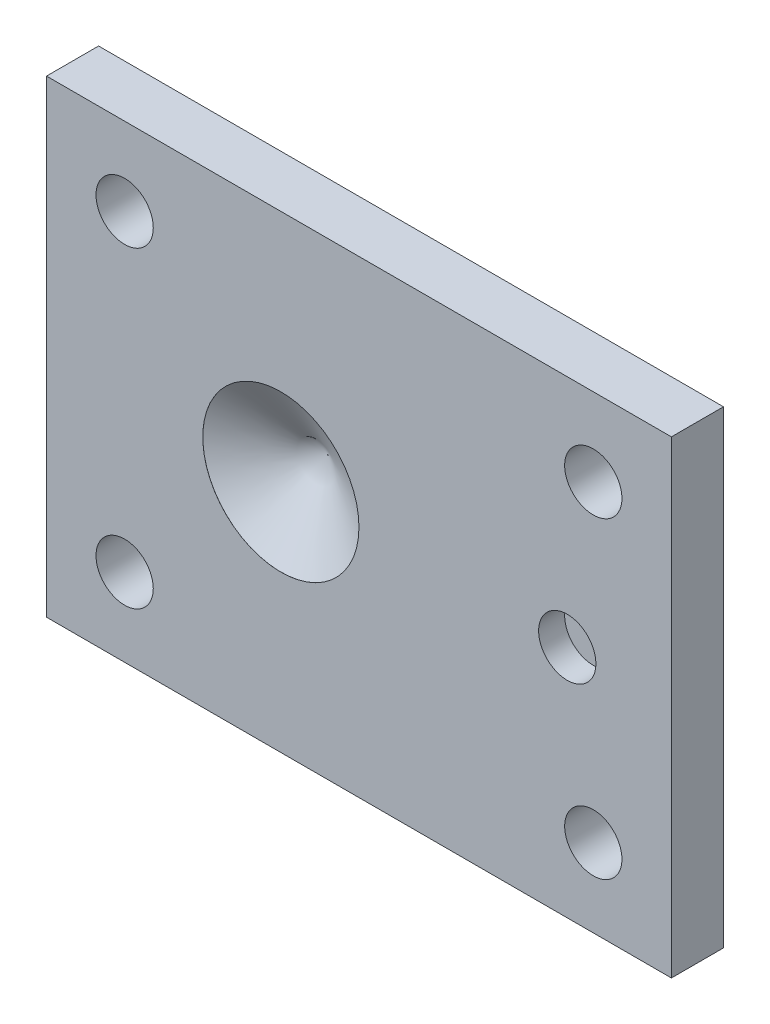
ISO-10303-21;
HEADER;
FILE_DESCRIPTION(('STEP AP214'),'2;1');
FILE_NAME('part.step','',(''),(''),'','','');
FILE_SCHEMA(('AUTOMOTIVE_DESIGN { 1 0 10303 214 1 1 1 1 }'));
ENDSEC;
DATA;
#1=APPLICATION_CONTEXT('core data for automotive mechanical design processes');
#2=APPLICATION_PROTOCOL_DEFINITION('international standard','automotive_design',2000,#1);
#3=PRODUCT_CONTEXT('',#1,'mechanical');
#4=PRODUCT('Part','Part','',(#3));
#5=PRODUCT_RELATED_PRODUCT_CATEGORY('part','',(#4));
#6=PRODUCT_DEFINITION_FORMATION('','',#4);
#7=PRODUCT_DEFINITION_CONTEXT('part definition',#1,'design');
#8=PRODUCT_DEFINITION('design','',#6,#7);
#9=PRODUCT_DEFINITION_SHAPE('','',#8);
#10=(LENGTH_UNIT() NAMED_UNIT(*) SI_UNIT(.MILLI.,.METRE.));
#11=(NAMED_UNIT(*) PLANE_ANGLE_UNIT() SI_UNIT($,.RADIAN.));
#12=(NAMED_UNIT(*) SI_UNIT($,.STERADIAN.) SOLID_ANGLE_UNIT());
#13=UNCERTAINTY_MEASURE_WITH_UNIT(LENGTH_MEASURE(1.E-05),#10,'distance_accuracy_value','');
#14=(GEOMETRIC_REPRESENTATION_CONTEXT(3) GLOBAL_UNCERTAINTY_ASSIGNED_CONTEXT((#13)) GLOBAL_UNIT_ASSIGNED_CONTEXT((#10,
#11,#12)) REPRESENTATION_CONTEXT('',''));
#15=CARTESIAN_POINT('',(0.,0.,0.));
#16=DIRECTION('',(0.,0.,1.));
#17=DIRECTION('',(1.,0.,0.));
#18=AXIS2_PLACEMENT_3D('',#15,#16,#17);
#19=CARTESIAN_POINT('',(0.,90.,10.));
#20=DIRECTION('',(1.,0.,0.));
#21=DIRECTION('',(0.,1.,0.));
#22=AXIS2_PLACEMENT_3D('',#19,#20,#21);
#23=PLANE('',#22);
#24=DIRECTION('',(0.,-1.,0.));
#25=VECTOR('',#24,1.);
#26=CARTESIAN_POINT('',(0.,90.,0.));
#27=LINE('',#26,#25);
#28=CARTESIAN_POINT('',(0.,90.,0.));
#29=VERTEX_POINT('',#28);
#30=CARTESIAN_POINT('',(0.,0.,0.));
#31=VERTEX_POINT('',#30);
#32=EDGE_CURVE('E121',#29,#31,#27,.T.);
#33=ORIENTED_EDGE('',*,*,#32,.T.);
#34=DIRECTION('',(0.,0.,-1.));
#35=VECTOR('',#34,1.);
#36=CARTESIAN_POINT('',(0.,0.,10.));
#37=LINE('',#36,#35);
#38=CARTESIAN_POINT('',(0.,0.,10.));
#39=VERTEX_POINT('',#38);
#40=EDGE_CURVE('E11',#39,#31,#37,.T.);
#41=ORIENTED_EDGE('',*,*,#40,.F.);
#42=DIRECTION('',(0.,-1.,0.));
#43=VECTOR('',#42,1.);
#44=CARTESIAN_POINT('',(0.,90.,10.));
#45=LINE('',#44,#43);
#46=CARTESIAN_POINT('',(0.,90.,10.));
#47=VERTEX_POINT('',#46);
#48=EDGE_CURVE('E130',#47,#39,#45,.T.);
#49=ORIENTED_EDGE('',*,*,#48,.F.);
#50=DIRECTION('',(0.,0.,-1.));
#51=VECTOR('',#50,1.);
#52=CARTESIAN_POINT('',(0.,90.,10.));
#53=LINE('',#52,#51);
#54=EDGE_CURVE('E136',#47,#29,#53,.T.);
#55=ORIENTED_EDGE('',*,*,#54,.T.);
#56=EDGE_LOOP('',(#33,#41,#49,#55));
#57=FACE_BOUND('',#56,.T.);
#58=ADVANCED_FACE('F36',(#57),#23,.F.);
#59=CARTESIAN_POINT('',(0.,0.,10.));
#60=DIRECTION('',(0.,1.,0.));
#61=DIRECTION('',(0.,0.,1.));
#62=AXIS2_PLACEMENT_3D('',#59,#60,#61);
#63=PLANE('',#62);
#64=DIRECTION('',(1.,0.,0.));
#65=VECTOR('',#64,1.);
#66=CARTESIAN_POINT('',(0.,0.,0.));
#67=LINE('',#66,#65);
#68=CARTESIAN_POINT('',(120.,0.,0.));
#69=VERTEX_POINT('',#68);
#70=EDGE_CURVE('E124',#31,#69,#67,.T.);
#71=ORIENTED_EDGE('',*,*,#70,.T.);
#72=DIRECTION('',(0.,0.,-1.));
#73=VECTOR('',#72,1.);
#74=CARTESIAN_POINT('',(120.,0.,10.));
#75=LINE('',#74,#73);
#76=CARTESIAN_POINT('',(120.,0.,10.));
#77=VERTEX_POINT('',#76);
#78=EDGE_CURVE('E43',#77,#69,#75,.T.);
#79=ORIENTED_EDGE('',*,*,#78,.F.);
#80=DIRECTION('',(1.,0.,0.));
#81=VECTOR('',#80,1.);
#82=CARTESIAN_POINT('',(0.,0.,10.));
#83=LINE('',#82,#81);
#84=EDGE_CURVE('E132',#39,#77,#83,.T.);
#85=ORIENTED_EDGE('',*,*,#84,.F.);
#86=ORIENTED_EDGE('',*,*,#40,.T.);
#87=EDGE_LOOP('',(#71,#79,#85,#86));
#88=FACE_BOUND('',#87,.T.);
#89=ADVANCED_FACE('F157',(#88),#63,.F.);
#90=CARTESIAN_POINT('',(120.,0.,10.));
#91=DIRECTION('',(-1.,0.,0.));
#92=DIRECTION('',(0.,0.,1.));
#93=AXIS2_PLACEMENT_3D('',#90,#91,#92);
#94=PLANE('',#93);
#95=DIRECTION('',(0.,1.,0.));
#96=VECTOR('',#95,1.);
#97=CARTESIAN_POINT('',(120.,0.,0.));
#98=LINE('',#97,#96);
#99=CARTESIAN_POINT('',(120.,90.,0.));
#100=VERTEX_POINT('',#99);
#101=EDGE_CURVE('E126',#69,#100,#98,.T.);
#102=ORIENTED_EDGE('',*,*,#101,.T.);
#103=DIRECTION('',(0.,0.,-1.));
#104=VECTOR('',#103,1.);
#105=CARTESIAN_POINT('',(120.,90.,10.));
#106=LINE('',#105,#104);
#107=CARTESIAN_POINT('',(120.,90.,10.));
#108=VERTEX_POINT('',#107);
#109=EDGE_CURVE('E139',#108,#100,#106,.T.);
#110=ORIENTED_EDGE('',*,*,#109,.F.);
#111=DIRECTION('',(0.,1.,0.));
#112=VECTOR('',#111,1.);
#113=CARTESIAN_POINT('',(120.,0.,10.));
#114=LINE('',#113,#112);
#115=EDGE_CURVE('E55',#77,#108,#114,.T.);
#116=ORIENTED_EDGE('',*,*,#115,.F.);
#117=ORIENTED_EDGE('',*,*,#78,.T.);
#118=EDGE_LOOP('',(#102,#110,#116,#117));
#119=FACE_BOUND('',#118,.T.);
#120=ADVANCED_FACE('F145',(#119),#94,.F.);
#121=CARTESIAN_POINT('',(120.,90.,10.));
#122=DIRECTION('',(0.,-1.,0.));
#123=DIRECTION('',(1.,0.,0.));
#124=AXIS2_PLACEMENT_3D('',#121,#122,#123);
#125=PLANE('',#124);
#126=DIRECTION('',(-1.,0.,0.));
#127=VECTOR('',#126,1.);
#128=CARTESIAN_POINT('',(120.,90.,0.));
#129=LINE('',#128,#127);
#130=EDGE_CURVE('E128',#100,#29,#129,.T.);
#131=ORIENTED_EDGE('',*,*,#130,.T.);
#132=ORIENTED_EDGE('',*,*,#54,.F.);
#133=DIRECTION('',(-1.,0.,0.));
#134=VECTOR('',#133,1.);
#135=CARTESIAN_POINT('',(120.,90.,10.));
#136=LINE('',#135,#134);
#137=EDGE_CURVE('E50',#108,#47,#136,.T.);
#138=ORIENTED_EDGE('',*,*,#137,.F.);
#139=ORIENTED_EDGE('',*,*,#109,.T.);
#140=EDGE_LOOP('',(#131,#132,#138,#139));
#141=FACE_BOUND('',#140,.T.);
#142=ADVANCED_FACE('F152',(#141),#125,.F.);
#143=CARTESIAN_POINT('',(0.,0.,10.));
#144=DIRECTION('',(0.,0.,1.));
#145=DIRECTION('',(1.,0.,0.));
#146=AXIS2_PLACEMENT_3D('',#143,#144,#145);
#147=PLANE('',#146);
#148=CARTESIAN_POINT('',(100.,45.,10.));
#149=DIRECTION('',(0.,0.,1.));
#150=DIRECTION('',(1.,0.,0.));
#151=AXIS2_PLACEMENT_3D('',#148,#149,#150);
#152=CIRCLE('',#151,5.5);
#153=CARTESIAN_POINT('',(105.5,45.,10.));
#154=VERTEX_POINT('',#153);
#155=EDGE_CURVE('E94',#154,#154,#152,.T.);
#156=ORIENTED_EDGE('',*,*,#155,.F.);
#157=EDGE_LOOP('',(#156));
#158=FACE_BOUND('',#157,.T.);
#159=CARTESIAN_POINT('',(45.,45.,10.));
#160=DIRECTION('',(0.,0.,1.));
#161=DIRECTION('',(1.,0.,0.));
#162=AXIS2_PLACEMENT_3D('',#159,#160,#161);
#163=CIRCLE('',#162,15.);
#164=CARTESIAN_POINT('',(60.,45.,10.));
#165=VERTEX_POINT('',#164);
#166=EDGE_CURVE('E87',#165,#165,#163,.T.);
#167=ORIENTED_EDGE('',*,*,#166,.F.);
#168=EDGE_LOOP('',(#167));
#169=FACE_BOUND('',#168,.T.);
#170=CARTESIAN_POINT('',(15.,15.,10.));
#171=DIRECTION('',(0.,0.,1.));
#172=DIRECTION('',(1.,0.,0.));
#173=AXIS2_PLACEMENT_3D('',#170,#171,#172);
#174=CIRCLE('',#173,5.5);
#175=CARTESIAN_POINT('',(20.5,15.,10.));
#176=VERTEX_POINT('',#175);
#177=EDGE_CURVE('E91',#176,#176,#174,.T.);
#178=ORIENTED_EDGE('',*,*,#177,.F.);
#179=EDGE_LOOP('',(#178));
#180=FACE_BOUND('',#179,.T.);
#181=CARTESIAN_POINT('',(105.,15.,10.));
#182=DIRECTION('',(0.,0.,1.));
#183=DIRECTION('',(1.,0.,0.));
#184=AXIS2_PLACEMENT_3D('',#181,#182,#183);
#185=CIRCLE('',#184,5.50000000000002);
#186=CARTESIAN_POINT('',(110.5,15.,10.));
#187=VERTEX_POINT('',#186);
#188=EDGE_CURVE('E103',#187,#187,#185,.T.);
#189=ORIENTED_EDGE('',*,*,#188,.F.);
#190=EDGE_LOOP('',(#189));
#191=FACE_BOUND('',#190,.T.);
#192=CARTESIAN_POINT('',(105.,75.,10.));
#193=DIRECTION('',(0.,0.,1.));
#194=DIRECTION('',(1.,0.,0.));
#195=AXIS2_PLACEMENT_3D('',#192,#193,#194);
#196=CIRCLE('',#195,5.50000000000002);
#197=CARTESIAN_POINT('',(110.5,75.,10.));
#198=VERTEX_POINT('',#197);
#199=EDGE_CURVE('E109',#198,#198,#196,.T.);
#200=ORIENTED_EDGE('',*,*,#199,.F.);
#201=EDGE_LOOP('',(#200));
#202=FACE_BOUND('',#201,.T.);
#203=CARTESIAN_POINT('',(15.,75.,10.));
#204=DIRECTION('',(0.,0.,1.));
#205=DIRECTION('',(1.,0.,0.));
#206=AXIS2_PLACEMENT_3D('',#203,#204,#205);
#207=CIRCLE('',#206,5.5);
#208=CARTESIAN_POINT('',(20.5,75.,10.));
#209=VERTEX_POINT('',#208);
#210=EDGE_CURVE('E115',#209,#209,#207,.T.);
#211=ORIENTED_EDGE('',*,*,#210,.F.);
#212=EDGE_LOOP('',(#211));
#213=FACE_BOUND('',#212,.T.);
#214=ORIENTED_EDGE('',*,*,#48,.T.);
#215=ORIENTED_EDGE('',*,*,#84,.T.);
#216=ORIENTED_EDGE('',*,*,#115,.T.);
#217=ORIENTED_EDGE('',*,*,#137,.T.);
#218=EDGE_LOOP('',(#214,#215,#216,#217));
#219=FACE_BOUND('',#218,.T.);
#220=ADVANCED_FACE('F156',(#158,#169,#180,#191,#202,#213,#219),#147,.T.);
#221=CARTESIAN_POINT('',(0.,0.,0.));
#222=DIRECTION('',(0.,0.,1.));
#223=DIRECTION('',(1.,0.,0.));
#224=AXIS2_PLACEMENT_3D('',#221,#222,#223);
#225=PLANE('',#224);
#226=CARTESIAN_POINT('',(15.,15.,0.));
#227=DIRECTION('',(0.,0.,1.));
#228=DIRECTION('',(1.,0.,0.));
#229=AXIS2_PLACEMENT_3D('',#226,#227,#228);
#230=CIRCLE('',#229,5.5);
#231=CARTESIAN_POINT('',(20.5,15.,0.));
#232=VERTEX_POINT('',#231);
#233=EDGE_CURVE('E100',#232,#232,#230,.T.);
#234=ORIENTED_EDGE('',*,*,#233,.T.);
#235=EDGE_LOOP('',(#234));
#236=FACE_BOUND('',#235,.T.);
#237=CARTESIAN_POINT('',(105.,15.,0.));
#238=DIRECTION('',(0.,0.,1.));
#239=DIRECTION('',(1.,0.,0.));
#240=AXIS2_PLACEMENT_3D('',#237,#238,#239);
#241=CIRCLE('',#240,5.50000000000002);
#242=CARTESIAN_POINT('',(110.5,15.,0.));
#243=VERTEX_POINT('',#242);
#244=EDGE_CURVE('E106',#243,#243,#241,.T.);
#245=ORIENTED_EDGE('',*,*,#244,.T.);
#246=EDGE_LOOP('',(#245));
#247=FACE_BOUND('',#246,.T.);
#248=CARTESIAN_POINT('',(105.,75.,0.));
#249=DIRECTION('',(0.,0.,1.));
#250=DIRECTION('',(1.,0.,0.));
#251=AXIS2_PLACEMENT_3D('',#248,#249,#250);
#252=CIRCLE('',#251,5.50000000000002);
#253=CARTESIAN_POINT('',(110.5,75.,0.));
#254=VERTEX_POINT('',#253);
#255=EDGE_CURVE('E112',#254,#254,#252,.T.);
#256=ORIENTED_EDGE('',*,*,#255,.T.);
#257=EDGE_LOOP('',(#256));
#258=FACE_BOUND('',#257,.T.);
#259=CARTESIAN_POINT('',(15.,75.,0.));
#260=DIRECTION('',(0.,0.,1.));
#261=DIRECTION('',(1.,0.,0.));
#262=AXIS2_PLACEMENT_3D('',#259,#260,#261);
#263=CIRCLE('',#262,5.5);
#264=CARTESIAN_POINT('',(20.5,75.,0.));
#265=VERTEX_POINT('',#264);
#266=EDGE_CURVE('E118',#265,#265,#263,.T.);
#267=ORIENTED_EDGE('',*,*,#266,.T.);
#268=EDGE_LOOP('',(#267));
#269=FACE_BOUND('',#268,.T.);
#270=ORIENTED_EDGE('',*,*,#32,.F.);
#271=ORIENTED_EDGE('',*,*,#130,.F.);
#272=ORIENTED_EDGE('',*,*,#101,.F.);
#273=ORIENTED_EDGE('',*,*,#70,.F.);
#274=EDGE_LOOP('',(#270,#271,#272,#273));
#275=FACE_BOUND('',#274,.T.);
#276=ADVANCED_FACE('F150',(#236,#247,#258,#269,#275),#225,.F.);
#277=CARTESIAN_POINT('',(15.,75.,0.));
#278=DIRECTION('',(0.,0.,1.));
#279=DIRECTION('',(1.,0.,0.));
#280=AXIS2_PLACEMENT_3D('',#277,#278,#279);
#281=CYLINDRICAL_SURFACE('',#280,5.5);
#282=ORIENTED_EDGE('',*,*,#266,.F.);
#283=EDGE_LOOP('',(#282));
#284=FACE_BOUND('',#283,.T.);
#285=ORIENTED_EDGE('',*,*,#210,.T.);
#286=EDGE_LOOP('',(#285));
#287=FACE_BOUND('',#286,.T.);
#288=ADVANCED_FACE('F172',(#284,#287),#281,.F.);
#289=CARTESIAN_POINT('',(105.,75.,0.));
#290=DIRECTION('',(0.,0.,1.));
#291=DIRECTION('',(1.,0.,0.));
#292=AXIS2_PLACEMENT_3D('',#289,#290,#291);
#293=CYLINDRICAL_SURFACE('',#292,5.50000000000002);
#294=ORIENTED_EDGE('',*,*,#255,.F.);
#295=EDGE_LOOP('',(#294));
#296=FACE_BOUND('',#295,.T.);
#297=ORIENTED_EDGE('',*,*,#199,.T.);
#298=EDGE_LOOP('',(#297));
#299=FACE_BOUND('',#298,.T.);
#300=ADVANCED_FACE('F176',(#296,#299),#293,.F.);
#301=CARTESIAN_POINT('',(105.,15.,0.));
#302=DIRECTION('',(0.,0.,1.));
#303=DIRECTION('',(1.,0.,0.));
#304=AXIS2_PLACEMENT_3D('',#301,#302,#303);
#305=CYLINDRICAL_SURFACE('',#304,5.50000000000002);
#306=ORIENTED_EDGE('',*,*,#244,.F.);
#307=EDGE_LOOP('',(#306));
#308=FACE_BOUND('',#307,.T.);
#309=ORIENTED_EDGE('',*,*,#188,.T.);
#310=EDGE_LOOP('',(#309));
#311=FACE_BOUND('',#310,.T.);
#312=ADVANCED_FACE('F180',(#308,#311),#305,.F.);
#313=CARTESIAN_POINT('',(15.,15.,0.));
#314=DIRECTION('',(0.,0.,1.));
#315=DIRECTION('',(1.,0.,0.));
#316=AXIS2_PLACEMENT_3D('',#313,#314,#315);
#317=CYLINDRICAL_SURFACE('',#316,5.5);
#318=ORIENTED_EDGE('',*,*,#233,.F.);
#319=EDGE_LOOP('',(#318));
#320=FACE_BOUND('',#319,.T.);
#321=ORIENTED_EDGE('',*,*,#177,.T.);
#322=EDGE_LOOP('',(#321));
#323=FACE_BOUND('',#322,.T.);
#324=ADVANCED_FACE('F184',(#320,#323),#317,.F.);
#325=CARTESIAN_POINT('',(45.,45.,10.));
#326=DIRECTION('',(0.,0.,1.));
#327=DIRECTION('',(1.,0.,0.));
#328=AXIS2_PLACEMENT_3D('',#325,#326,#327);
#329=CYLINDRICAL_SURFACE('',#328,15.);
#330=CARTESIAN_POINT('',(45.,45.,9.99));
#331=DIRECTION('',(0.,0.,1.));
#332=DIRECTION('',(1.,0.,0.));
#333=AXIS2_PLACEMENT_3D('',#330,#331,#332);
#334=CIRCLE('',#333,15.);
#335=CARTESIAN_POINT('',(60.,45.,9.99));
#336=VERTEX_POINT('',#335);
#337=EDGE_CURVE('E85',#336,#336,#334,.T.);
#338=ORIENTED_EDGE('',*,*,#337,.F.);
#339=EDGE_LOOP('',(#338));
#340=FACE_BOUND('',#339,.T.);
#341=ORIENTED_EDGE('',*,*,#166,.T.);
#342=EDGE_LOOP('',(#341));
#343=FACE_BOUND('',#342,.T.);
#344=ADVANCED_FACE('F81',(#340,#343),#329,.F.);
#345=CARTESIAN_POINT('',(45.,45.,9.99));
#346=DIRECTION('',(0.,0.,1.));
#347=DIRECTION('',(1.,0.,0.));
#348=AXIS2_PLACEMENT_3D('',#345,#346,#347);
#349=CONICAL_SURFACE('',#348,15.,1.02974425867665);
#350=CARTESIAN_POINT('',(45.,45.,0.977090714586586));
#351=VERTEX_POINT('',#350);
#352=VERTEX_LOOP('',#351);
#353=FACE_BOUND('',#352,.T.);
#354=ORIENTED_EDGE('',*,*,#337,.T.);
#355=EDGE_LOOP('',(#354));
#356=FACE_BOUND('',#355,.T.);
#357=ADVANCED_FACE('F77',(#353,#356),#349,.F.);
#358=CARTESIAN_POINT('',(100.,45.,5.));
#359=DIRECTION('',(0.,0.,1.));
#360=DIRECTION('',(1.,0.,0.));
#361=AXIS2_PLACEMENT_3D('',#358,#359,#360);
#362=CYLINDRICAL_SURFACE('',#361,5.5);
#363=CARTESIAN_POINT('',(100.,45.,5.));
#364=DIRECTION('',(0.,0.,1.));
#365=DIRECTION('',(1.,0.,0.));
#366=AXIS2_PLACEMENT_3D('',#363,#364,#365);
#367=CIRCLE('',#366,5.5);
#368=CARTESIAN_POINT('',(105.5,45.,5.));
#369=VERTEX_POINT('',#368);
#370=EDGE_CURVE('E88',#369,#369,#367,.T.);
#371=ORIENTED_EDGE('',*,*,#370,.F.);
#372=EDGE_LOOP('',(#371));
#373=FACE_BOUND('',#372,.T.);
#374=ORIENTED_EDGE('',*,*,#155,.T.);
#375=EDGE_LOOP('',(#374));
#376=FACE_BOUND('',#375,.T.);
#377=ADVANCED_FACE('F80',(#373,#376),#362,.F.);
#378=CARTESIAN_POINT('',(100.,45.,5.));
#379=DIRECTION('',(0.,0.,1.));
#380=DIRECTION('',(1.,0.,0.));
#381=AXIS2_PLACEMENT_3D('',#378,#379,#380);
#382=PLANE('',#381);
#383=ORIENTED_EDGE('',*,*,#370,.T.);
#384=EDGE_LOOP('',(#383));
#385=FACE_BOUND('',#384,.T.);
#386=ADVANCED_FACE('F193',(#385),#382,.T.);
#387=CLOSED_SHELL('',(#58,#89,#120,#142,#220,#276,#288,#300,#312,#324,#344,#357,#377,#386));
#388=MANIFOLD_SOLID_BREP('B2',#387);
#389=ADVANCED_BREP_SHAPE_REPRESENTATION('',(#18,#388),#14);
#390=SHAPE_DEFINITION_REPRESENTATION(#9,#389);
ENDSEC;
END-ISO-10303-21;
